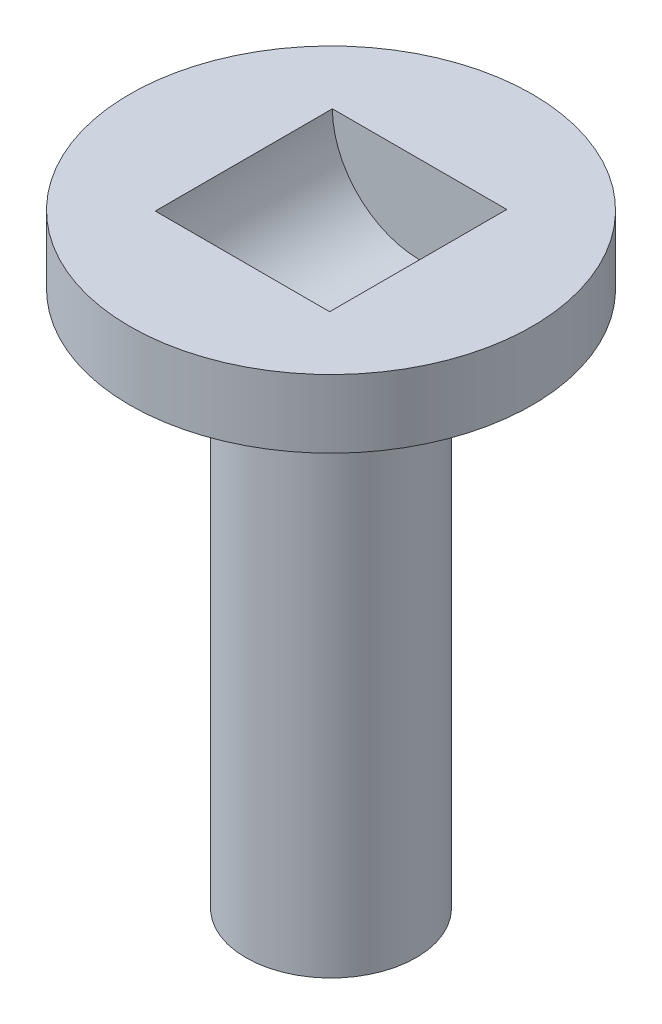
ISO-10303-21;
HEADER;
FILE_DESCRIPTION(('STEP AP214'),'2;1');
FILE_NAME('part.step','',(''),(''),'','','');
FILE_SCHEMA(('AUTOMOTIVE_DESIGN { 1 0 10303 214 1 1 1 1 }'));
ENDSEC;
DATA;
#1=APPLICATION_CONTEXT('core data for automotive mechanical design processes');
#2=APPLICATION_PROTOCOL_DEFINITION('international standard','automotive_design',2000,#1);
#3=PRODUCT_CONTEXT('',#1,'mechanical');
#4=PRODUCT('Part','Part','',(#3));
#5=PRODUCT_RELATED_PRODUCT_CATEGORY('part','',(#4));
#6=PRODUCT_DEFINITION_FORMATION('','',#4);
#7=PRODUCT_DEFINITION_CONTEXT('part definition',#1,'design');
#8=PRODUCT_DEFINITION('design','',#6,#7);
#9=PRODUCT_DEFINITION_SHAPE('','',#8);
#10=(LENGTH_UNIT() NAMED_UNIT(*) SI_UNIT(.MILLI.,.METRE.));
#11=(NAMED_UNIT(*) PLANE_ANGLE_UNIT() SI_UNIT($,.RADIAN.));
#12=(NAMED_UNIT(*) SI_UNIT($,.STERADIAN.) SOLID_ANGLE_UNIT());
#13=UNCERTAINTY_MEASURE_WITH_UNIT(LENGTH_MEASURE(1.E-05),#10,'distance_accuracy_value','');
#14=(GEOMETRIC_REPRESENTATION_CONTEXT(3) GLOBAL_UNCERTAINTY_ASSIGNED_CONTEXT((#13)) GLOBAL_UNIT_ASSIGNED_CONTEXT((#10,
#11,#12)) REPRESENTATION_CONTEXT('',''));
#15=CARTESIAN_POINT('',(0.,0.,0.));
#16=DIRECTION('',(0.,0.,1.));
#17=DIRECTION('',(1.,0.,0.));
#18=AXIS2_PLACEMENT_3D('',#15,#16,#17);
#19=CARTESIAN_POINT('',(0.,20.,0.));
#20=DIRECTION('',(0.,-1.,0.));
#21=DIRECTION('',(0.,0.,-1.));
#22=AXIS2_PLACEMENT_3D('',#19,#20,#21);
#23=CYLINDRICAL_SURFACE('',#22,3.175);
#24=CARTESIAN_POINT('',(0.,0.,0.));
#25=DIRECTION('',(0.,1.,0.));
#26=DIRECTION('',(0.,0.,1.));
#27=AXIS2_PLACEMENT_3D('',#24,#25,#26);
#28=CIRCLE('',#27,3.175);
#29=CARTESIAN_POINT('',(0.,0.,3.175));
#30=VERTEX_POINT('',#29);
#31=EDGE_CURVE('E74',#30,#30,#28,.T.);
#32=ORIENTED_EDGE('',*,*,#31,.T.);
#33=EDGE_LOOP('',(#32));
#34=FACE_BOUND('',#33,.T.);
#35=CARTESIAN_POINT('',(0.,19.19,0.));
#36=DIRECTION('',(0.,1.,0.));
#37=DIRECTION('',(0.,0.,1.));
#38=AXIS2_PLACEMENT_3D('',#35,#36,#37);
#39=CIRCLE('',#38,3.175);
#40=CARTESIAN_POINT('',(0.,19.19,3.175));
#41=VERTEX_POINT('',#40);
#42=EDGE_CURVE('E62',#41,#41,#39,.T.);
#43=ORIENTED_EDGE('',*,*,#42,.F.);
#44=EDGE_LOOP('',(#43));
#45=FACE_BOUND('',#44,.T.);
#46=ADVANCED_FACE('F32',(#34,#45),#23,.T.);
#47=CARTESIAN_POINT('',(0.,0.,0.));
#48=DIRECTION('',(0.,1.,0.));
#49=DIRECTION('',(0.,0.,1.));
#50=AXIS2_PLACEMENT_3D('',#47,#48,#49);
#51=PLANE('',#50);
#52=CARTESIAN_POINT('',(0.,0.,0.));
#53=DIRECTION('',(0.,-1.,0.));
#54=DIRECTION('',(0.,0.,-1.));
#55=AXIS2_PLACEMENT_3D('',#52,#53,#54);
#56=CIRCLE('',#55,1.35);
#57=CARTESIAN_POINT('',(0.,0.,-1.35));
#58=VERTEX_POINT('',#57);
#59=EDGE_CURVE('E78',#58,#58,#56,.T.);
#60=ORIENTED_EDGE('',*,*,#59,.F.);
#61=EDGE_LOOP('',(#60));
#62=FACE_BOUND('',#61,.T.);
#63=ORIENTED_EDGE('',*,*,#31,.F.);
#64=EDGE_LOOP('',(#63));
#65=FACE_BOUND('',#64,.T.);
#66=ADVANCED_FACE('F107',(#62,#65),#51,.F.);
#67=CARTESIAN_POINT('',(0.,10.,0.));
#68=DIRECTION('',(0.,-1.,0.));
#69=DIRECTION('',(0.,0.,-1.));
#70=AXIS2_PLACEMENT_3D('',#67,#68,#69);
#71=CYLINDRICAL_SURFACE('',#70,1.35);
#72=CARTESIAN_POINT('',(0.,10.,0.));
#73=DIRECTION('',(0.,-1.,0.));
#74=DIRECTION('',(0.,0.,-1.));
#75=AXIS2_PLACEMENT_3D('',#72,#73,#74);
#76=CIRCLE('',#75,1.35);
#77=CARTESIAN_POINT('',(0.,10.,-1.35));
#78=VERTEX_POINT('',#77);
#79=EDGE_CURVE('E77',#78,#78,#76,.T.);
#80=ORIENTED_EDGE('',*,*,#79,.F.);
#81=EDGE_LOOP('',(#80));
#82=FACE_BOUND('',#81,.T.);
#83=ORIENTED_EDGE('',*,*,#59,.T.);
#84=EDGE_LOOP('',(#83));
#85=FACE_BOUND('',#84,.T.);
#86=ADVANCED_FACE('F112',(#82,#85),#71,.F.);
#87=CARTESIAN_POINT('',(0.,10.,0.));
#88=DIRECTION('',(0.,-1.,0.));
#89=DIRECTION('',(0.,0.,-1.));
#90=AXIS2_PLACEMENT_3D('',#87,#88,#89);
#91=PLANE('',#90);
#92=ORIENTED_EDGE('',*,*,#79,.T.);
#93=EDGE_LOOP('',(#92));
#94=FACE_BOUND('',#93,.T.);
#95=ADVANCED_FACE('F121',(#94),#91,.T.);
#96=CARTESIAN_POINT('',(0.,19.19,0.));
#97=DIRECTION('',(0.,1.,0.));
#98=DIRECTION('',(0.,0.,1.));
#99=AXIS2_PLACEMENT_3D('',#96,#97,#98);
#100=PLANE('',#99);
#101=CARTESIAN_POINT('',(0.,19.19,0.));
#102=DIRECTION('',(0.,1.,0.));
#103=DIRECTION('',(0.,0.,1.));
#104=AXIS2_PLACEMENT_3D('',#101,#102,#103);
#105=CIRCLE('',#104,4.85);
#106=CARTESIAN_POINT('',(0.,19.19,4.85));
#107=VERTEX_POINT('',#106);
#108=EDGE_CURVE('E92',#107,#107,#105,.T.);
#109=ORIENTED_EDGE('',*,*,#108,.F.);
#110=EDGE_LOOP('',(#109));
#111=FACE_BOUND('',#110,.T.);
#112=ORIENTED_EDGE('',*,*,#42,.T.);
#113=EDGE_LOOP('',(#112));
#114=FACE_BOUND('',#113,.T.);
#115=ADVANCED_FACE('F118',(#111,#114),#100,.F.);
#116=CARTESIAN_POINT('',(0.,19.19,0.));
#117=DIRECTION('',(0.,1.,0.));
#118=DIRECTION('',(0.,0.,1.));
#119=AXIS2_PLACEMENT_3D('',#116,#117,#118);
#120=CYLINDRICAL_SURFACE('',#119,4.85);
#121=ORIENTED_EDGE('',*,*,#108,.T.);
#122=EDGE_LOOP('',(#121));
#123=FACE_BOUND('',#122,.T.);
#124=CARTESIAN_POINT('',(0.,20.,0.));
#125=DIRECTION('',(0.,1.,0.));
#126=DIRECTION('',(0.,0.,1.));
#127=AXIS2_PLACEMENT_3D('',#124,#125,#126);
#128=CIRCLE('',#127,4.85);
#129=CARTESIAN_POINT('',(0.,20.,4.85));
#130=VERTEX_POINT('',#129);
#131=EDGE_CURVE('E87',#130,#130,#128,.T.);
#132=ORIENTED_EDGE('',*,*,#131,.F.);
#133=EDGE_LOOP('',(#132));
#134=FACE_BOUND('',#133,.T.);
#135=ADVANCED_FACE('F120',(#123,#134),#120,.T.);
#136=CARTESIAN_POINT('',(0.,22.54,0.));
#137=DIRECTION('',(0.,1.,0.));
#138=DIRECTION('',(0.,0.,1.));
#139=AXIS2_PLACEMENT_3D('',#136,#137,#138);
#140=PLANE('',#139);
#141=DIRECTION('',(1.,0.,0.));
#142=VECTOR('',#141,1.);
#143=CARTESIAN_POINT('',(0.,22.54,3.3));
#144=LINE('',#143,#142);
#145=CARTESIAN_POINT('',(-3.25,22.54,3.3));
#146=VERTEX_POINT('',#145);
#147=CARTESIAN_POINT('',(3.25,22.54,3.3));
#148=VERTEX_POINT('',#147);
#149=EDGE_CURVE('E11',#146,#148,#144,.T.);
#150=ORIENTED_EDGE('',*,*,#149,.F.);
#151=DIRECTION('',(0.,0.,-1.));
#152=VECTOR('',#151,1.);
#153=CARTESIAN_POINT('',(-3.25,22.54,3.3));
#154=LINE('',#153,#152);
#155=CARTESIAN_POINT('',(-3.25,22.54,-3.302));
#156=VERTEX_POINT('',#155);
#157=EDGE_CURVE('E52',#146,#156,#154,.T.);
#158=ORIENTED_EDGE('',*,*,#157,.T.);
#159=DIRECTION('',(1.,0.,0.));
#160=VECTOR('',#159,1.);
#161=CARTESIAN_POINT('',(0.,22.54,-3.302));
#162=LINE('',#161,#160);
#163=CARTESIAN_POINT('',(3.25,22.54,-3.302));
#164=VERTEX_POINT('',#163);
#165=EDGE_CURVE('E58',#156,#164,#162,.T.);
#166=ORIENTED_EDGE('',*,*,#165,.T.);
#167=DIRECTION('',(0.,0.,-1.));
#168=VECTOR('',#167,1.);
#169=CARTESIAN_POINT('',(3.25,22.54,3.3));
#170=LINE('',#169,#168);
#171=EDGE_CURVE('E39',#164,#148,#170,.F.);
#172=ORIENTED_EDGE('',*,*,#171,.T.);
#173=EDGE_LOOP('',(#150,#158,#166,#172));
#174=FACE_BOUND('',#173,.T.);
#175=CARTESIAN_POINT('',(0.,22.54,0.));
#176=DIRECTION('',(0.,1.,0.));
#177=DIRECTION('',(0.,0.,1.));
#178=AXIS2_PLACEMENT_3D('',#175,#176,#177);
#179=CIRCLE('',#178,7.5);
#180=CARTESIAN_POINT('',(0.,22.54,7.5));
#181=VERTEX_POINT('',#180);
#182=EDGE_CURVE('E81',#181,#181,#179,.T.);
#183=ORIENTED_EDGE('',*,*,#182,.T.);
#184=EDGE_LOOP('',(#183));
#185=FACE_BOUND('',#184,.T.);
#186=ADVANCED_FACE('F68',(#174,#185),#140,.T.);
#187=CARTESIAN_POINT('',(0.,22.54,0.));
#188=DIRECTION('',(0.,-1.,0.));
#189=DIRECTION('',(0.,0.,-1.));
#190=AXIS2_PLACEMENT_3D('',#187,#188,#189);
#191=CYLINDRICAL_SURFACE('',#190,7.5);
#192=ORIENTED_EDGE('',*,*,#182,.F.);
#193=EDGE_LOOP('',(#192));
#194=FACE_BOUND('',#193,.T.);
#195=CARTESIAN_POINT('',(0.,20.,0.));
#196=DIRECTION('',(0.,1.,0.));
#197=DIRECTION('',(0.,0.,1.));
#198=AXIS2_PLACEMENT_3D('',#195,#196,#197);
#199=CIRCLE('',#198,7.5);
#200=CARTESIAN_POINT('',(0.,20.,7.5));
#201=VERTEX_POINT('',#200);
#202=EDGE_CURVE('E84',#201,#201,#199,.T.);
#203=ORIENTED_EDGE('',*,*,#202,.T.);
#204=EDGE_LOOP('',(#203));
#205=FACE_BOUND('',#204,.T.);
#206=ADVANCED_FACE('F136',(#194,#205),#191,.T.);
#207=CARTESIAN_POINT('',(0.,20.,0.));
#208=DIRECTION('',(0.,1.,0.));
#209=DIRECTION('',(0.,0.,1.));
#210=AXIS2_PLACEMENT_3D('',#207,#208,#209);
#211=PLANE('',#210);
#212=ORIENTED_EDGE('',*,*,#131,.T.);
#213=EDGE_LOOP('',(#212));
#214=FACE_BOUND('',#213,.T.);
#215=ORIENTED_EDGE('',*,*,#202,.F.);
#216=EDGE_LOOP('',(#215));
#217=FACE_BOUND('',#216,.T.);
#218=ADVANCED_FACE('F104',(#214,#217),#211,.F.);
#219=CARTESIAN_POINT('',(0.,22.54,3.3));
#220=DIRECTION('',(0.,0.,-1.));
#221=DIRECTION('',(-1.,0.,0.));
#222=AXIS2_PLACEMENT_3D('',#219,#220,#221);
#223=CYLINDRICAL_SURFACE('',#222,3.25);
#224=CARTESIAN_POINT('',(0.,22.54,-3.302));
#225=DIRECTION('',(0.,0.,1.));
#226=DIRECTION('',(1.,0.,0.));
#227=AXIS2_PLACEMENT_3D('',#224,#225,#226);
#228=CIRCLE('',#227,3.25);
#229=EDGE_CURVE('E45',#156,#164,#228,.T.);
#230=ORIENTED_EDGE('',*,*,#229,.F.);
#231=ORIENTED_EDGE('',*,*,#157,.F.);
#232=CARTESIAN_POINT('',(0.,22.54,3.3));
#233=DIRECTION('',(0.,0.,1.));
#234=DIRECTION('',(1.,0.,0.));
#235=AXIS2_PLACEMENT_3D('',#232,#233,#234);
#236=CIRCLE('',#235,3.25);
#237=EDGE_CURVE('E65',#146,#148,#236,.T.);
#238=ORIENTED_EDGE('',*,*,#237,.T.);
#239=ORIENTED_EDGE('',*,*,#171,.F.);
#240=EDGE_LOOP('',(#230,#231,#238,#239));
#241=FACE_BOUND('',#240,.T.);
#242=ADVANCED_FACE('F64',(#241),#223,.F.);
#243=CARTESIAN_POINT('',(0.,22.54,3.3));
#244=DIRECTION('',(0.,0.,1.));
#245=DIRECTION('',(1.,0.,0.));
#246=AXIS2_PLACEMENT_3D('',#243,#244,#245);
#247=PLANE('',#246);
#248=ORIENTED_EDGE('',*,*,#149,.T.);
#249=ORIENTED_EDGE('',*,*,#237,.F.);
#250=EDGE_LOOP('',(#248,#249));
#251=FACE_BOUND('',#250,.T.);
#252=ADVANCED_FACE('F96',(#251),#247,.F.);
#253=CARTESIAN_POINT('',(0.,22.54,-3.302));
#254=DIRECTION('',(0.,0.,1.));
#255=DIRECTION('',(1.,0.,0.));
#256=AXIS2_PLACEMENT_3D('',#253,#254,#255);
#257=PLANE('',#256);
#258=ORIENTED_EDGE('',*,*,#229,.T.);
#259=ORIENTED_EDGE('',*,*,#165,.F.);
#260=EDGE_LOOP('',(#258,#259));
#261=FACE_BOUND('',#260,.T.);
#262=ADVANCED_FACE('F59',(#261),#257,.T.);
#263=CLOSED_SHELL('',(#46,#66,#86,#95,#115,#135,#186,#206,#218,#242,#252,#262));
#264=MANIFOLD_SOLID_BREP('B2',#263);
#265=ADVANCED_BREP_SHAPE_REPRESENTATION('',(#18,#264),#14);
#266=SHAPE_DEFINITION_REPRESENTATION(#9,#265);
ENDSEC;
END-ISO-10303-21;
